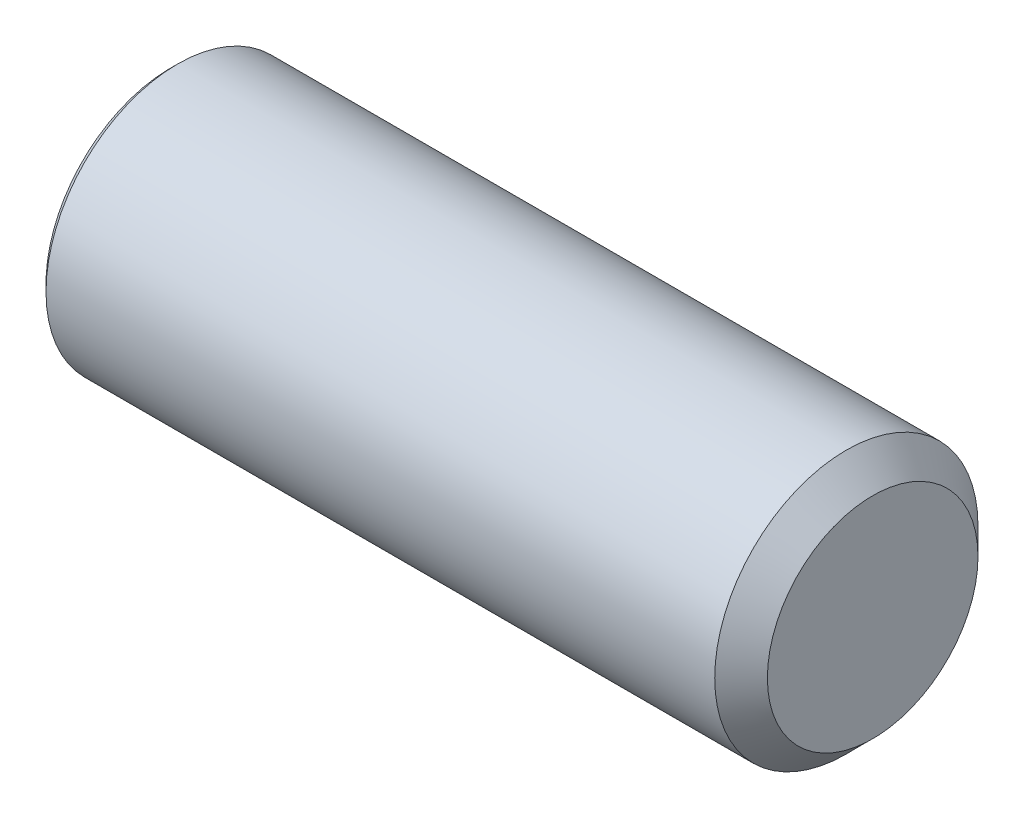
ISO-10303-21;
HEADER;
FILE_DESCRIPTION(('STEP AP214'),'2;1');
FILE_NAME('part.step','',(''),(''),'','','');
FILE_SCHEMA(('AUTOMOTIVE_DESIGN { 1 0 10303 214 1 1 1 1 }'));
ENDSEC;
DATA;
#1=APPLICATION_CONTEXT('core data for automotive mechanical design processes');
#2=APPLICATION_PROTOCOL_DEFINITION('international standard','automotive_design',2000,#1);
#3=PRODUCT_CONTEXT('',#1,'mechanical');
#4=PRODUCT('Part','Part','',(#3));
#5=PRODUCT_RELATED_PRODUCT_CATEGORY('part','',(#4));
#6=PRODUCT_DEFINITION_FORMATION('','',#4);
#7=PRODUCT_DEFINITION_CONTEXT('part definition',#1,'design');
#8=PRODUCT_DEFINITION('design','',#6,#7);
#9=PRODUCT_DEFINITION_SHAPE('','',#8);
#10=(LENGTH_UNIT() NAMED_UNIT(*) SI_UNIT(.MILLI.,.METRE.));
#11=(NAMED_UNIT(*) PLANE_ANGLE_UNIT() SI_UNIT($,.RADIAN.));
#12=(NAMED_UNIT(*) SI_UNIT($,.STERADIAN.) SOLID_ANGLE_UNIT());
#13=UNCERTAINTY_MEASURE_WITH_UNIT(LENGTH_MEASURE(1.E-05),#10,'distance_accuracy_value','');
#14=(GEOMETRIC_REPRESENTATION_CONTEXT(3) GLOBAL_UNCERTAINTY_ASSIGNED_CONTEXT((#13)) GLOBAL_UNIT_ASSIGNED_CONTEXT((#10,
#11,#12)) REPRESENTATION_CONTEXT('',''));
#15=CARTESIAN_POINT('',(0.,0.,0.));
#16=DIRECTION('',(0.,0.,1.));
#17=DIRECTION('',(1.,0.,0.));
#18=AXIS2_PLACEMENT_3D('',#15,#16,#17);
#19=CARTESIAN_POINT('',(3.96875000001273,0.,0.));
#20=DIRECTION('',(-1.,0.,0.));
#21=DIRECTION('',(0.,0.,1.));
#22=AXIS2_PLACEMENT_3D('',#19,#20,#21);
#23=CONICAL_SURFACE('',#22,1.13030000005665,1.02974425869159);
#24=CARTESIAN_POINT('',(3.96875,0.,0.));
#25=DIRECTION('',(-1.,0.,0.));
#26=DIRECTION('',(0.,0.,1.));
#27=AXIS2_PLACEMENT_3D('',#24,#25,#26);
#28=CIRCLE('',#27,1.1303);
#29=CARTESIAN_POINT('',(3.96875,0.,1.1303));
#30=VERTEX_POINT('',#29);
#31=EDGE_CURVE('E75',#30,#30,#28,.T.);
#32=ORIENTED_EDGE('',*,*,#31,.T.);
#33=EDGE_LOOP('',(#32));
#34=FACE_BOUND('',#33,.T.);
#35=CARTESIAN_POINT('',(4.64790275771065,0.,0.));
#36=VERTEX_POINT('',#35);
#37=VERTEX_LOOP('',#36);
#38=FACE_BOUND('',#37,.T.);
#39=ADVANCED_FACE('F17',(#34,#38),#23,.F.);
#40=CARTESIAN_POINT('',(5.15811039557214,0.,0.));
#41=DIRECTION('',(-1.,0.,0.));
#42=DIRECTION('',(0.,0.,1.));
#43=AXIS2_PLACEMENT_3D('',#40,#41,#42);
#44=CYLINDRICAL_SURFACE('',#43,1.1303);
#45=CARTESIAN_POINT('',(-5.03030156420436,0.,0.));
#46=DIRECTION('',(-1.,0.,0.));
#47=DIRECTION('',(0.,1.,0.));
#48=AXIS2_PLACEMENT_3D('',#45,#46,#47);
#49=CIRCLE('',#48,1.13029999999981);
#50=CARTESIAN_POINT('',(-5.03030156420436,1.13029999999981,0.));
#51=VERTEX_POINT('',#50);
#52=EDGE_CURVE('E69',#51,#51,#49,.T.);
#53=ORIENTED_EDGE('',*,*,#52,.T.);
#54=EDGE_LOOP('',(#53));
#55=FACE_BOUND('',#54,.T.);
#56=ORIENTED_EDGE('',*,*,#31,.F.);
#57=EDGE_LOOP('',(#56));
#58=FACE_BOUND('',#57,.T.);
#59=ADVANCED_FACE('F29',(#55,#58),#44,.F.);
#60=CARTESIAN_POINT('',(-5.55624999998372,0.,0.));
#61=DIRECTION('',(-1.,0.,0.));
#62=DIRECTION('',(0.,0.,1.));
#63=AXIS2_PLACEMENT_3D('',#60,#61,#62);
#64=CONICAL_SURFACE('',#63,1.58750000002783,0.715584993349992);
#65=ORIENTED_EDGE('',*,*,#52,.F.);
#66=EDGE_LOOP('',(#65));
#67=FACE_BOUND('',#66,.T.);
#68=CARTESIAN_POINT('',(-5.55624999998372,0.,0.));
#69=DIRECTION('',(-1.,0.,0.));
#70=DIRECTION('',(0.,0.,1.));
#71=AXIS2_PLACEMENT_3D('',#68,#69,#70);
#72=CIRCLE('',#71,1.58750000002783);
#73=CARTESIAN_POINT('',(-5.55624999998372,0.,1.58750000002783));
#74=VERTEX_POINT('',#73);
#75=EDGE_CURVE('E20',#74,#74,#72,.T.);
#76=ORIENTED_EDGE('',*,*,#75,.T.);
#77=EDGE_LOOP('',(#76));
#78=FACE_BOUND('',#77,.T.);
#79=ADVANCED_FACE('F35',(#67,#78),#64,.F.);
#80=CARTESIAN_POINT('',(7.14375,0.,0.));
#81=DIRECTION('',(1.,0.,0.));
#82=DIRECTION('',(0.,0.,-1.));
#83=AXIS2_PLACEMENT_3D('',#80,#81,#82);
#84=PLANE('',#83);
#85=CARTESIAN_POINT('',(7.14375000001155,0.,0.));
#86=DIRECTION('',(-1.,0.,0.));
#87=DIRECTION('',(0.,0.,1.));
#88=AXIS2_PLACEMENT_3D('',#85,#86,#87);
#89=CIRCLE('',#88,1.90499999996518);
#90=CARTESIAN_POINT('',(7.14375000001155,0.,1.90499999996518));
#91=VERTEX_POINT('',#90);
#92=EDGE_CURVE('E72',#91,#91,#89,.T.);
#93=ORIENTED_EDGE('',*,*,#92,.F.);
#94=EDGE_LOOP('',(#93));
#95=FACE_BOUND('',#94,.T.);
#96=ADVANCED_FACE('F57',(#95),#84,.T.);
#97=CARTESIAN_POINT('',(-5.55625,0.,0.));
#98=DIRECTION('',(1.,0.,0.));
#99=DIRECTION('',(0.,0.,-1.));
#100=AXIS2_PLACEMENT_3D('',#97,#98,#99);
#101=PLANE('',#100);
#102=ORIENTED_EDGE('',*,*,#75,.F.);
#103=EDGE_LOOP('',(#102));
#104=FACE_BOUND('',#103,.T.);
#105=CARTESIAN_POINT('',(-5.55624999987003,0.,0.));
#106=DIRECTION('',(1.,0.,0.));
#107=DIRECTION('',(0.,0.,-1.));
#108=AXIS2_PLACEMENT_3D('',#105,#106,#107);
#109=CIRCLE('',#108,2.25424999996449);
#110=CARTESIAN_POINT('',(-5.55624999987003,0.,-2.25424999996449));
#111=VERTEX_POINT('',#110);
#112=EDGE_CURVE('E74',#111,#111,#109,.T.);
#113=ORIENTED_EDGE('',*,*,#112,.F.);
#114=EDGE_LOOP('',(#113));
#115=FACE_BOUND('',#114,.T.);
#116=ADVANCED_FACE('F53',(#104,#115),#101,.F.);
#117=CARTESIAN_POINT('',(6.66750000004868,0.,0.));
#118=DIRECTION('',(-1.,0.,0.));
#119=DIRECTION('',(0.,0.,1.));
#120=AXIS2_PLACEMENT_3D('',#117,#118,#119);
#121=CONICAL_SURFACE('',#120,2.38124999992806,0.785398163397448);
#122=CARTESIAN_POINT('',(6.6675,0.,0.));
#123=DIRECTION('',(1.,0.,0.));
#124=DIRECTION('',(0.,0.,-1.));
#125=AXIS2_PLACEMENT_3D('',#122,#123,#124);
#126=CIRCLE('',#125,2.38125);
#127=CARTESIAN_POINT('',(6.6675,0.,-2.38125));
#128=VERTEX_POINT('',#127);
#129=EDGE_CURVE('E24',#128,#128,#126,.F.);
#130=ORIENTED_EDGE('',*,*,#129,.F.);
#131=EDGE_LOOP('',(#130));
#132=FACE_BOUND('',#131,.T.);
#133=ORIENTED_EDGE('',*,*,#92,.T.);
#134=EDGE_LOOP('',(#133));
#135=FACE_BOUND('',#134,.T.);
#136=ADVANCED_FACE('F46',(#132,#135),#121,.T.);
#137=CARTESIAN_POINT('',(-5.42925000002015,0.,0.));
#138=DIRECTION('',(1.,0.,0.));
#139=DIRECTION('',(0.,0.,-1.));
#140=AXIS2_PLACEMENT_3D('',#137,#138,#139);
#141=CONICAL_SURFACE('',#140,2.38124999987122,0.785398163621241);
#142=ORIENTED_EDGE('',*,*,#112,.T.);
#143=EDGE_LOOP('',(#142));
#144=FACE_BOUND('',#143,.T.);
#145=CARTESIAN_POINT('',(-5.42925,0.,0.));
#146=DIRECTION('',(1.,0.,0.));
#147=DIRECTION('',(0.,0.,-1.));
#148=AXIS2_PLACEMENT_3D('',#145,#146,#147);
#149=CIRCLE('',#148,2.38125);
#150=CARTESIAN_POINT('',(-5.42925,0.,-2.38125));
#151=VERTEX_POINT('',#150);
#152=EDGE_CURVE('E11',#151,#151,#149,.T.);
#153=ORIENTED_EDGE('',*,*,#152,.F.);
#154=EDGE_LOOP('',(#153));
#155=FACE_BOUND('',#154,.T.);
#156=ADVANCED_FACE('F40',(#144,#155),#141,.T.);
#157=CARTESIAN_POINT('',(-7.14375,0.,0.));
#158=DIRECTION('',(1.,0.,0.));
#159=DIRECTION('',(0.,0.,-1.));
#160=AXIS2_PLACEMENT_3D('',#157,#158,#159);
#161=CYLINDRICAL_SURFACE('',#160,2.38125);
#162=ORIENTED_EDGE('',*,*,#152,.T.);
#163=EDGE_LOOP('',(#162));
#164=FACE_BOUND('',#163,.T.);
#165=ORIENTED_EDGE('',*,*,#129,.T.);
#166=EDGE_LOOP('',(#165));
#167=FACE_BOUND('',#166,.T.);
#168=ADVANCED_FACE('F38',(#164,#167),#161,.T.);
#169=CLOSED_SHELL('',(#39,#59,#79,#96,#116,#136,#156,#168));
#170=MANIFOLD_SOLID_BREP('B1',#169);
#171=ADVANCED_BREP_SHAPE_REPRESENTATION('',(#18,#170),#14);
#172=SHAPE_DEFINITION_REPRESENTATION(#9,#171);
ENDSEC;
END-ISO-10303-21;
